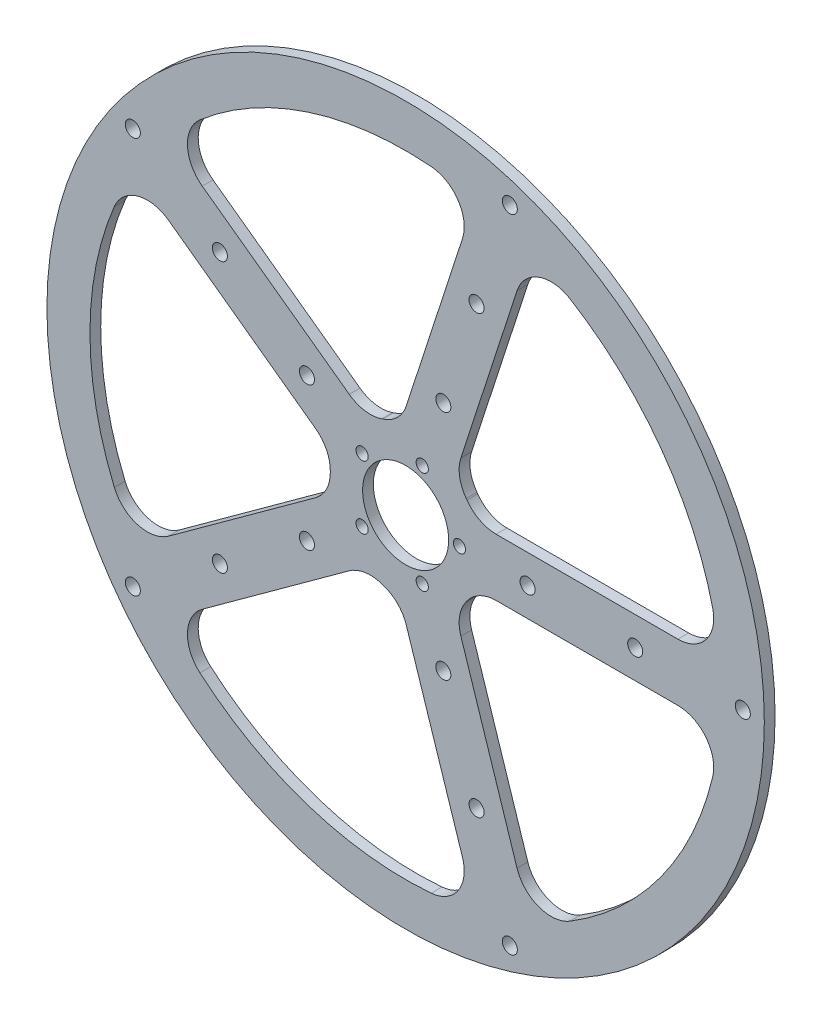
from build123d import *

# Parameters (mm, degrees)
ESQUISSE1_R      = 500
ESQUISSE1_R_2    = 10.5
ESQUISSE1_R_3    = 8.5
ESQUISSE1_R_4    = 60
EXTRUSION1_DEPTH = 15


with BuildPart() as part:
    # Esquisse1 → Extrusion1 (new body)
    with BuildSketch(Plane.XY):
        Circle(ESQUISSE1_R)
        with Locations((170, 0)):
            Circle(ESQUISSE1_R_2, mode=Mode.SUBTRACT)
        with Locations((320, 0)):
            Circle(ESQUISSE1_R_2, mode=Mode.SUBTRACT)
        with Locations((470, 0)):
            Circle(ESQUISSE1_R_2, mode=Mode.SUBTRACT)
        with Locations((75, 0)):
            Circle(ESQUISSE1_R_3, mode=Mode.SUBTRACT)
        with Locations((23.176274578, -71.329238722)):
            Circle(ESQUISSE1_R_3, mode=Mode.SUBTRACT)
        with Locations((52.532889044, -161.67960777)):
            Circle(ESQUISSE1_R_2, mode=Mode.SUBTRACT)
        with Locations((98.8854382, -304.338085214)):
            Circle(ESQUISSE1_R_2, mode=Mode.SUBTRACT)
        with Locations((145.237987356, -446.996562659)):
            Circle(ESQUISSE1_R_2, mode=Mode.SUBTRACT)
        with Locations((-60.676274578, -44.083893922)):
            Circle(ESQUISSE1_R_3, mode=Mode.SUBTRACT)
        with Locations((-137.532889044, -99.92349289)):
            Circle(ESQUISSE1_R_2, mode=Mode.SUBTRACT)
        with Locations((-258.8854382, -188.091280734)):
            Circle(ESQUISSE1_R_2, mode=Mode.SUBTRACT)
        with Locations((-380.237987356, -276.259068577)):
            Circle(ESQUISSE1_R_2, mode=Mode.SUBTRACT)
        with Locations((-60.676274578, 44.083893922)):
            Circle(ESQUISSE1_R_3, mode=Mode.SUBTRACT)
        with Locations((-137.532889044, 99.92349289)):
            Circle(ESQUISSE1_R_2, mode=Mode.SUBTRACT)
        with Locations((-258.8854382, 188.091280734)):
            Circle(ESQUISSE1_R_2, mode=Mode.SUBTRACT)
        with Locations((-380.237987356, 276.259068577)):
            Circle(ESQUISSE1_R_2, mode=Mode.SUBTRACT)
        with Locations((23.176274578, 71.329238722)):
            Circle(ESQUISSE1_R_3, mode=Mode.SUBTRACT)
        with Locations((52.532889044, 161.67960777)):
            Circle(ESQUISSE1_R_2, mode=Mode.SUBTRACT)
        with Locations((98.8854382, 304.338085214)):
            Circle(ESQUISSE1_R_2, mode=Mode.SUBTRACT)
        with Locations((145.237987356, 446.996562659)):
            Circle(ESQUISSE1_R_2, mode=Mode.SUBTRACT)
        Circle(ESQUISSE1_R_4, mode=Mode.SUBTRACT)
        with BuildLine():
            Line((379.47331922, 40), (126.194294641, 40))
            ThreePointArc((126.194294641, 40), (103.299021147, 45.54995555), (85.48645766, 60.967741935))
            ThreePointArc((85.48645766, 60.967741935), (84.946784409, 61.717451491), (84.400536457, 62.462384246))
            ThreePointArc((84.400536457, 62.462384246), (75.241735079, 84.167496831), (77.038442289, 107.657226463))
            Line((77.038442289, 107.657226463), (155.305965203, 348.53989323))
            ThreePointArc((155.305965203, 348.53989323), (185.488424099, 379.974759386), (228.866328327, 375.792767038))
            ThreePointArc((228.866328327, 375.792767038), (355.967477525, 258.625511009), (428.123744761, 101.538461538))
            ThreePointArc((428.123744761, 101.538461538), (418.696546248, 58.991316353), (379.47331922, 40))
        make_face(mode=Mode.SUBTRACT)
        with BuildLine():
            Line((379.47331922, -40), (126.194294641, -40))
            ThreePointArc((126.194294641, -40), (103.299021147, -45.54995555), (85.48645766, -60.967741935))
            ThreePointArc((85.48645766, -60.967741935), (84.946784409, -61.717451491), (84.400536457, -62.462384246))
            ThreePointArc((84.400536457, -62.462384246), (75.241735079, -84.167496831), (77.038442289, -107.657226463))
            Line((77.038442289, -107.657226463), (155.305965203, -348.53989323))
            ThreePointArc((155.305965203, -348.53989323), (185.488424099, -379.974759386), (228.866328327, -375.792767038))
            ThreePointArc((228.866328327, -375.792767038), (355.967477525, -258.625511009), (428.123744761, -101.538461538))
            ThreePointArc((428.123744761, -101.538461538), (418.696546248, -58.991316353), (379.47331922, -40))
        make_face(mode=Mode.SUBTRACT)
        with BuildLine():
            Line((79.221443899, -373.26125278), (0.953920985, -132.378586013))
            ThreePointArc((0.953920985, -132.378586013), (-11.399429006, -112.318917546), (-31.567000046, -100.142520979))
            ThreePointArc((-31.567000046, -100.142520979), (-32.446784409, -99.860934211), (-33.324057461, -99.571618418))
            ThreePointArc((-33.324057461, -99.571618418), (-56.797071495, -97.568329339), (-78.581918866, -106.535825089))
            Line((-78.581918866, -106.535825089), (-283.488954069, -255.409500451))
            ThreePointArc((-283.488954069, -255.409500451), (-304.058395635, -293.82863252), (-286.676574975, -333.791164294))
            ThreePointArc((-286.676574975, -333.791164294), (-135.967477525, -418.46486717), (35.728697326, -438.546987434))
            ThreePointArc((35.728697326, -438.546987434), (73.280272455, -416.433397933), (79.221443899, -373.26125278))
        make_face(mode=Mode.SUBTRACT)
        with BuildLine():
            Line((-330.511774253, -190.688140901), (-125.60473905, -41.814465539))
            ThreePointArc((-125.60473905, -41.814465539), (-110.344255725, -23.866953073), (-104.995936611, -0.923739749))
            ThreePointArc((-104.995936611, -0.923739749), (-105, 0), (-104.995936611, 0.923739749))
            ThreePointArc((-104.995936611, 0.923739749), (-110.344255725, 23.866953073), (-125.60473905, 41.814465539))
            Line((-125.60473905, 41.814465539), (-330.511774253, 190.688140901))
            ThreePointArc((-330.511774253, 190.688140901), (-373.406847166, 198.37867762), (-406.04219544, 169.49848236))
            ThreePointArc((-406.04219544, 169.49848236), (-440, 0), (-406.04219544, -169.49848236))
            ThreePointArc((-406.04219544, -169.49848236), (-373.406847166, -198.37867762), (-330.511774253, -190.688140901))
        make_face(mode=Mode.SUBTRACT)
        with BuildLine():
            Line((-283.488954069, 255.409500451), (-78.581918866, 106.535825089))
            ThreePointArc((-78.581918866, 106.535825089), (-56.797071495, 97.568329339), (-33.324057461, 99.571618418))
            ThreePointArc((-33.324057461, 99.571618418), (-32.446784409, 99.860934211), (-31.567000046, 100.142520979))
            ThreePointArc((-31.567000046, 100.142520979), (-11.399429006, 112.318917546), (0.953920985, 132.378586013))
            Line((0.953920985, 132.378586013), (79.221443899, 373.26125278))
            ThreePointArc((79.221443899, 373.26125278), (73.280272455, 416.433397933), (35.728697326, 438.546987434))
            ThreePointArc((35.728697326, 438.546987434), (-135.967477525, 418.46486717), (-286.676574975, 333.791164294))
            ThreePointArc((-286.676574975, 333.791164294), (-304.058395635, 293.82863252), (-283.488954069, 255.409500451))
        make_face(mode=Mode.SUBTRACT)
    extrude(amount=EXTRUSION1_DEPTH)


solid = part.part
